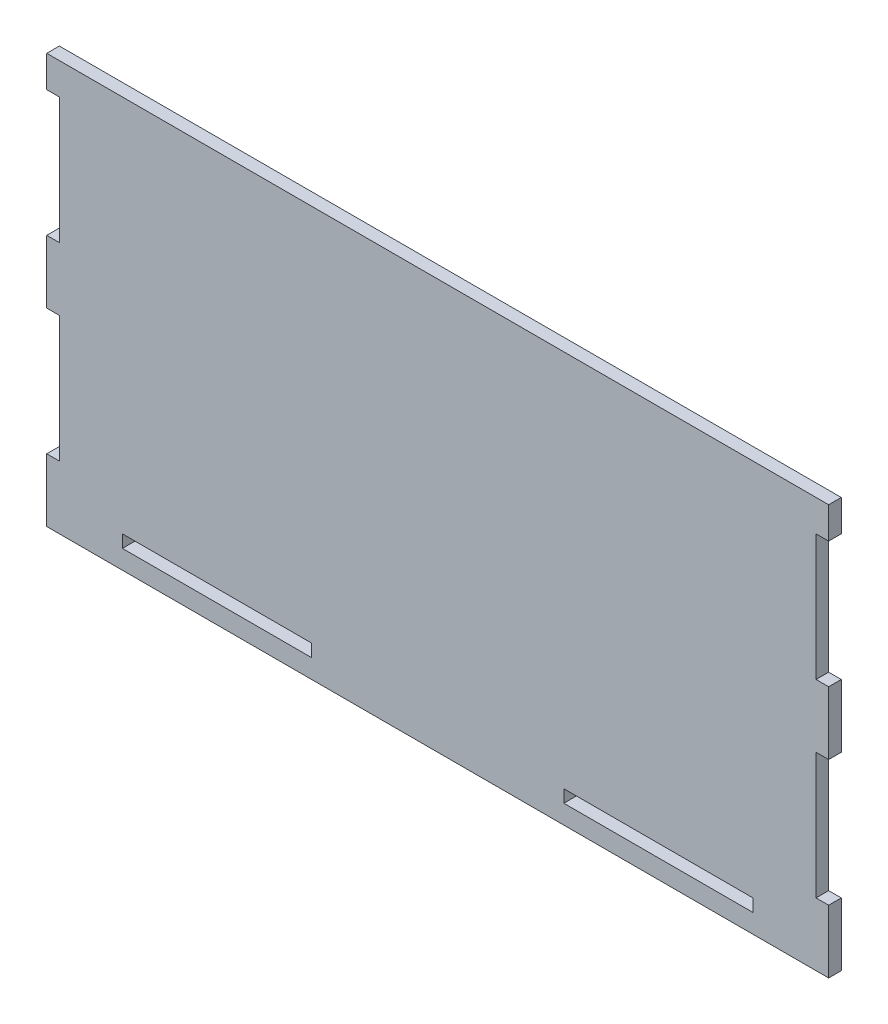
from build123d import *

# Parameters (mm, degrees)
CROQUIS1_W              = 300
CROQUIS1_H              = 20
SALIENTE_EXTRUIR1_DEPTH = 20


with BuildPart() as part:
    # Croquis1 → Saliente-Extruir1 (new body)
    with BuildSketch(Plane.XY):
        Polygon((0, 0), (1240, 0), (1240, 100), (1220, 100), (1220, 300), (1240, 300), (1240, 400), (1220, 400), (1220, 600), (1240, 600), (1240, 650), (0, 650), (0, 600), (20, 600), (20, 400), (0, 400), (0, 300), (20, 300), (20, 100), (0, 100), align=None)
        with Locations((270, 40)):
            Rectangle(CROQUIS1_W, CROQUIS1_H, mode=Mode.SUBTRACT)
        with Locations((970, 40)):
            Rectangle(CROQUIS1_W, CROQUIS1_H, mode=Mode.SUBTRACT)
    extrude(amount=SALIENTE_EXTRUIR1_DEPTH)


solid = part.part
